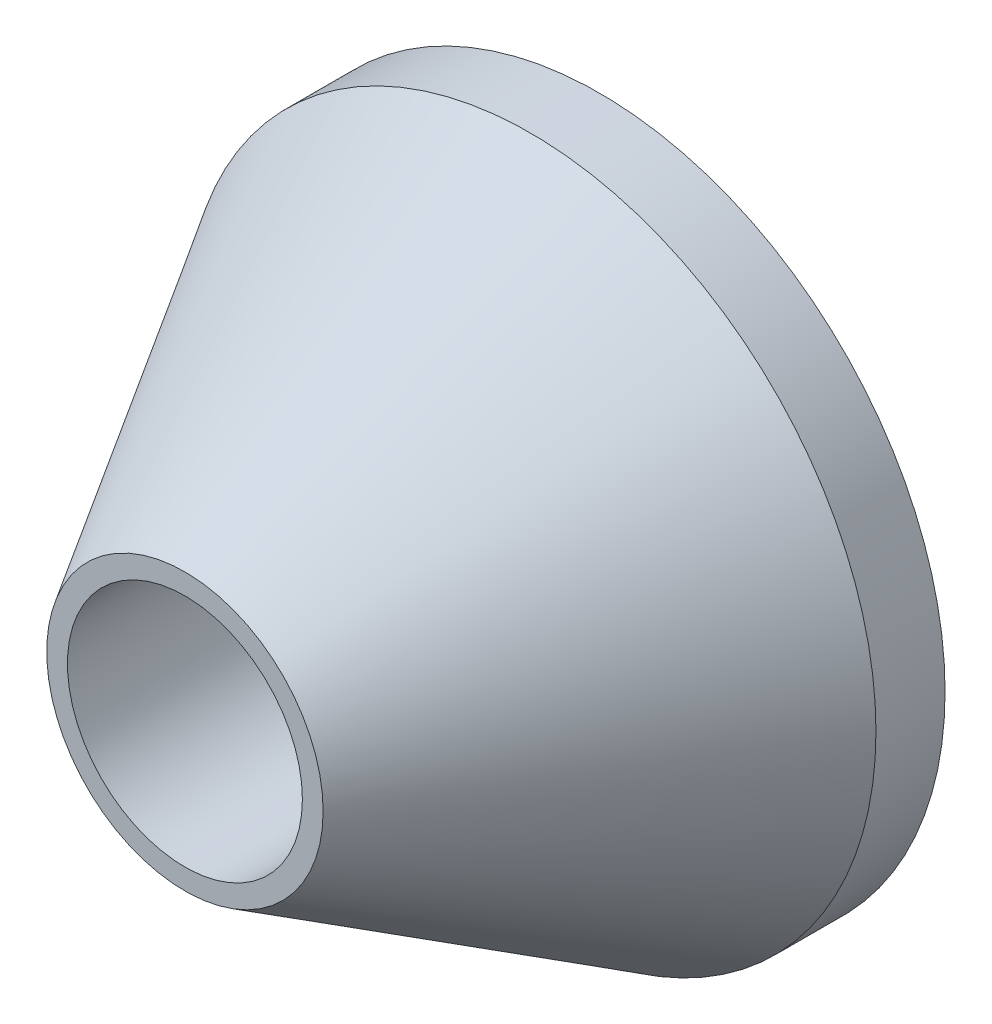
ISO-10303-21;
HEADER;
FILE_DESCRIPTION(('STEP AP214'),'2;1');
FILE_NAME('part.step','',(''),(''),'','','');
FILE_SCHEMA(('AUTOMOTIVE_DESIGN { 1 0 10303 214 1 1 1 1 }'));
ENDSEC;
DATA;
#1=APPLICATION_CONTEXT('core data for automotive mechanical design processes');
#2=APPLICATION_PROTOCOL_DEFINITION('international standard','automotive_design',2000,#1);
#3=PRODUCT_CONTEXT('',#1,'mechanical');
#4=PRODUCT('Part','Part','',(#3));
#5=PRODUCT_RELATED_PRODUCT_CATEGORY('part','',(#4));
#6=PRODUCT_DEFINITION_FORMATION('','',#4);
#7=PRODUCT_DEFINITION_CONTEXT('part definition',#1,'design');
#8=PRODUCT_DEFINITION('design','',#6,#7);
#9=PRODUCT_DEFINITION_SHAPE('','',#8);
#10=(LENGTH_UNIT() NAMED_UNIT(*) SI_UNIT(.MILLI.,.METRE.));
#11=(NAMED_UNIT(*) PLANE_ANGLE_UNIT() SI_UNIT($,.RADIAN.));
#12=(NAMED_UNIT(*) SI_UNIT($,.STERADIAN.) SOLID_ANGLE_UNIT());
#13=UNCERTAINTY_MEASURE_WITH_UNIT(LENGTH_MEASURE(1.E-05),#10,'distance_accuracy_value','');
#14=(GEOMETRIC_REPRESENTATION_CONTEXT(3) GLOBAL_UNCERTAINTY_ASSIGNED_CONTEXT((#13)) GLOBAL_UNIT_ASSIGNED_CONTEXT((#10,
#11,#12)) REPRESENTATION_CONTEXT('',''));
#15=CARTESIAN_POINT('',(0.,0.,0.));
#16=DIRECTION('',(0.,0.,1.));
#17=DIRECTION('',(1.,0.,0.));
#18=AXIS2_PLACEMENT_3D('',#15,#16,#17);
#19=CARTESIAN_POINT('',(0.,0.,3.));
#20=DIRECTION('',(0.,0.,1.));
#21=DIRECTION('',(1.,0.,0.));
#22=AXIS2_PLACEMENT_3D('',#19,#20,#21);
#23=PLANE('',#22);
#24=CARTESIAN_POINT('',(0.,0.,3.));
#25=DIRECTION('',(0.,0.,1.));
#26=DIRECTION('',(1.,0.,0.));
#27=AXIS2_PLACEMENT_3D('',#24,#25,#26);
#28=CIRCLE('',#27,0.999999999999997);
#29=CARTESIAN_POINT('',(0.999999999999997,0.,3.));
#30=VERTEX_POINT('',#29);
#31=EDGE_CURVE('E32',#30,#30,#28,.T.);
#32=ORIENTED_EDGE('',*,*,#31,.T.);
#33=EDGE_LOOP('',(#32));
#34=FACE_BOUND('',#33,.T.);
#35=CARTESIAN_POINT('',(0.,0.,3.));
#36=DIRECTION('',(0.,0.,1.));
#37=DIRECTION('',(1.,0.,0.));
#38=AXIS2_PLACEMENT_3D('',#35,#36,#37);
#39=CIRCLE('',#38,0.85);
#40=CARTESIAN_POINT('',(0.85,0.,3.));
#41=VERTEX_POINT('',#40);
#42=EDGE_CURVE('E40',#41,#41,#39,.T.);
#43=ORIENTED_EDGE('',*,*,#42,.F.);
#44=EDGE_LOOP('',(#43));
#45=FACE_BOUND('',#44,.T.);
#46=ADVANCED_FACE('F25',(#34,#45),#23,.T.);
#47=CARTESIAN_POINT('',(0.,0.,0.));
#48=DIRECTION('',(0.,0.,1.));
#49=DIRECTION('',(1.,0.,0.));
#50=AXIS2_PLACEMENT_3D('',#47,#48,#49);
#51=PLANE('',#50);
#52=CARTESIAN_POINT('',(0.,0.,0.));
#53=DIRECTION('',(0.,0.,1.));
#54=DIRECTION('',(1.,0.,0.));
#55=AXIS2_PLACEMENT_3D('',#52,#53,#54);
#56=CIRCLE('',#55,2.5);
#57=CARTESIAN_POINT('',(2.5,0.,0.));
#58=VERTEX_POINT('',#57);
#59=EDGE_CURVE('E36',#58,#58,#56,.T.);
#60=ORIENTED_EDGE('',*,*,#59,.F.);
#61=EDGE_LOOP('',(#60));
#62=FACE_BOUND('',#61,.T.);
#63=CARTESIAN_POINT('',(0.,0.,0.));
#64=DIRECTION('',(0.,0.,1.));
#65=DIRECTION('',(1.,0.,0.));
#66=AXIS2_PLACEMENT_3D('',#63,#64,#65);
#67=CIRCLE('',#66,0.85);
#68=CARTESIAN_POINT('',(0.85,0.,0.));
#69=VERTEX_POINT('',#68);
#70=EDGE_CURVE('E45',#69,#69,#67,.T.);
#71=ORIENTED_EDGE('',*,*,#70,.T.);
#72=EDGE_LOOP('',(#71));
#73=FACE_BOUND('',#72,.T.);
#74=ADVANCED_FACE('F49',(#62,#73),#51,.F.);
#75=CARTESIAN_POINT('',(0.,0.,3.));
#76=DIRECTION('',(0.,0.,-1.));
#77=DIRECTION('',(-1.,0.,0.));
#78=AXIS2_PLACEMENT_3D('',#75,#76,#77);
#79=CYLINDRICAL_SURFACE('',#78,2.5);
#80=CARTESIAN_POINT('',(0.,0.,0.499999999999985));
#81=DIRECTION('',(0.,0.,1.));
#82=DIRECTION('',(1.,0.,0.));
#83=AXIS2_PLACEMENT_3D('',#80,#81,#82);
#84=CIRCLE('',#83,2.5);
#85=CARTESIAN_POINT('',(2.5,0.,0.499999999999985));
#86=VERTEX_POINT('',#85);
#87=EDGE_CURVE('E10',#86,#86,#84,.F.);
#88=ORIENTED_EDGE('',*,*,#87,.T.);
#89=EDGE_LOOP('',(#88));
#90=FACE_BOUND('',#89,.T.);
#91=ORIENTED_EDGE('',*,*,#59,.T.);
#92=EDGE_LOOP('',(#91));
#93=FACE_BOUND('',#92,.T.);
#94=ADVANCED_FACE('F27',(#90,#93),#79,.T.);
#95=CARTESIAN_POINT('',(0.,0.,3.));
#96=DIRECTION('',(0.,0.,-1.));
#97=DIRECTION('',(-1.,0.,0.));
#98=AXIS2_PLACEMENT_3D('',#95,#96,#97);
#99=CYLINDRICAL_SURFACE('',#98,0.85);
#100=ORIENTED_EDGE('',*,*,#42,.T.);
#101=EDGE_LOOP('',(#100));
#102=FACE_BOUND('',#101,.T.);
#103=ORIENTED_EDGE('',*,*,#70,.F.);
#104=EDGE_LOOP('',(#103));
#105=FACE_BOUND('',#104,.T.);
#106=ADVANCED_FACE('F51',(#102,#105),#99,.F.);
#107=CARTESIAN_POINT('',(0.,0.,3.));
#108=DIRECTION('',(0.,0.,-1.));
#109=DIRECTION('',(-1.,0.,0.));
#110=AXIS2_PLACEMENT_3D('',#107,#108,#109);
#111=CONICAL_SURFACE('',#110,0.999999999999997,0.540419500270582);
#112=ORIENTED_EDGE('',*,*,#87,.F.);
#113=EDGE_LOOP('',(#112));
#114=FACE_BOUND('',#113,.T.);
#115=ORIENTED_EDGE('',*,*,#31,.F.);
#116=EDGE_LOOP('',(#115));
#117=FACE_BOUND('',#116,.T.);
#118=ADVANCED_FACE('F53',(#114,#117),#111,.T.);
#119=CLOSED_SHELL('',(#46,#74,#94,#106,#118));
#120=MANIFOLD_SOLID_BREP('B2',#119);
#121=ADVANCED_BREP_SHAPE_REPRESENTATION('',(#18,#120),#14);
#122=SHAPE_DEFINITION_REPRESENTATION(#9,#121);
ENDSEC;
END-ISO-10303-21;
